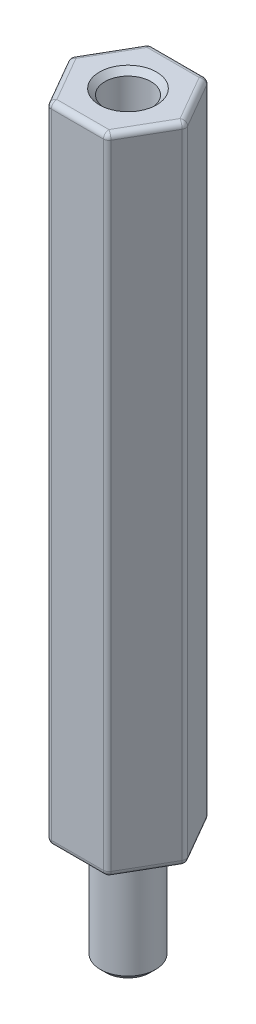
ISO-10303-21;
HEADER;
FILE_DESCRIPTION(('STEP AP214'),'2;1');
FILE_NAME('part.step','',(''),(''),'','','');
FILE_SCHEMA(('AUTOMOTIVE_DESIGN { 1 0 10303 214 1 1 1 1 }'));
ENDSEC;
DATA;
#1=APPLICATION_CONTEXT('core data for automotive mechanical design processes');
#2=APPLICATION_PROTOCOL_DEFINITION('international standard','automotive_design',2000,#1);
#3=PRODUCT_CONTEXT('',#1,'mechanical');
#4=PRODUCT('Part','Part','',(#3));
#5=PRODUCT_RELATED_PRODUCT_CATEGORY('part','',(#4));
#6=PRODUCT_DEFINITION_FORMATION('','',#4);
#7=PRODUCT_DEFINITION_CONTEXT('part definition',#1,'design');
#8=PRODUCT_DEFINITION('design','',#6,#7);
#9=PRODUCT_DEFINITION_SHAPE('','',#8);
#10=(LENGTH_UNIT() NAMED_UNIT(*) SI_UNIT(.MILLI.,.METRE.));
#11=(NAMED_UNIT(*) PLANE_ANGLE_UNIT() SI_UNIT($,.RADIAN.));
#12=(NAMED_UNIT(*) SI_UNIT($,.STERADIAN.) SOLID_ANGLE_UNIT());
#13=UNCERTAINTY_MEASURE_WITH_UNIT(LENGTH_MEASURE(1.E-05),#10,'distance_accuracy_value','');
#14=(GEOMETRIC_REPRESENTATION_CONTEXT(3) GLOBAL_UNCERTAINTY_ASSIGNED_CONTEXT((#13)) GLOBAL_UNIT_ASSIGNED_CONTEXT((#10,
#11,#12)) REPRESENTATION_CONTEXT('',''));
#15=CARTESIAN_POINT('',(0.,0.,0.));
#16=DIRECTION('',(0.,0.,1.));
#17=DIRECTION('',(1.,0.,0.));
#18=AXIS2_PLACEMENT_3D('',#15,#16,#17);
#19=CARTESIAN_POINT('',(0.,35.,0.));
#20=DIRECTION('',(0.,1.,0.));
#21=DIRECTION('',(0.,0.,1.));
#22=AXIS2_PLACEMENT_3D('',#19,#20,#21);
#23=PLANE('',#22);
#24=CARTESIAN_POINT('',(0.,35.,0.));
#25=DIRECTION('',(0.,1.,0.));
#26=DIRECTION('',(0.,0.,1.));
#27=AXIS2_PLACEMENT_3D('',#24,#25,#26);
#28=CIRCLE('',#27,1.55);
#29=CARTESIAN_POINT('',(0.,35.,1.55));
#30=VERTEX_POINT('',#29);
#31=EDGE_CURVE('E319',#30,#30,#28,.F.);
#32=ORIENTED_EDGE('',*,*,#31,.T.);
#33=EDGE_LOOP('',(#32));
#34=FACE_BOUND('',#33,.T.);
#35=DIRECTION('',(-0.5,0.,0.866025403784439));
#36=VECTOR('',#35,1.);
#37=CARTESIAN_POINT('',(-2.82901631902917,35.,0.));
#38=LINE('',#37,#36);
#39=CARTESIAN_POINT('',(-1.41450815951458,35.,-2.45));
#40=VERTEX_POINT('',#39);
#41=CARTESIAN_POINT('',(-2.82901631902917,35.,0.));
#42=VERTEX_POINT('',#41);
#43=EDGE_CURVE('E63',#40,#42,#38,.T.);
#44=ORIENTED_EDGE('',*,*,#43,.T.);
#45=DIRECTION('',(0.5,0.,0.866025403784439));
#46=VECTOR('',#45,1.);
#47=CARTESIAN_POINT('',(-1.41450815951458,35.,2.45));
#48=LINE('',#47,#46);
#49=CARTESIAN_POINT('',(-1.41450815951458,35.,2.45));
#50=VERTEX_POINT('',#49);
#51=EDGE_CURVE('E646',#42,#50,#48,.T.);
#52=ORIENTED_EDGE('',*,*,#51,.T.);
#53=DIRECTION('',(1.,0.,0.));
#54=VECTOR('',#53,1.);
#55=CARTESIAN_POINT('',(1.41450815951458,35.,2.45));
#56=LINE('',#55,#54);
#57=CARTESIAN_POINT('',(1.41450815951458,35.,2.45));
#58=VERTEX_POINT('',#57);
#59=EDGE_CURVE('E633',#50,#58,#56,.T.);
#60=ORIENTED_EDGE('',*,*,#59,.T.);
#61=DIRECTION('',(0.5,0.,-0.866025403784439));
#62=VECTOR('',#61,1.);
#63=CARTESIAN_POINT('',(2.82901631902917,35.,0.));
#64=LINE('',#63,#62);
#65=CARTESIAN_POINT('',(2.82901631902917,35.,0.));
#66=VERTEX_POINT('',#65);
#67=EDGE_CURVE('E636',#58,#66,#64,.T.);
#68=ORIENTED_EDGE('',*,*,#67,.T.);
#69=DIRECTION('',(-0.5,0.,-0.866025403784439));
#70=VECTOR('',#69,1.);
#71=CARTESIAN_POINT('',(1.41450815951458,35.,-2.45));
#72=LINE('',#71,#70);
#73=CARTESIAN_POINT('',(1.41450815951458,35.,-2.45));
#74=VERTEX_POINT('',#73);
#75=EDGE_CURVE('E639',#66,#74,#72,.T.);
#76=ORIENTED_EDGE('',*,*,#75,.T.);
#77=DIRECTION('',(-1.,0.,0.));
#78=VECTOR('',#77,1.);
#79=CARTESIAN_POINT('',(-1.41450815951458,35.,-2.45));
#80=LINE('',#79,#78);
#81=EDGE_CURVE('E68',#74,#40,#80,.T.);
#82=ORIENTED_EDGE('',*,*,#81,.T.);
#83=EDGE_LOOP('',(#44,#52,#60,#68,#76,#82));
#84=FACE_BOUND('',#83,.T.);
#85=ADVANCED_FACE('F47',(#34,#84),#23,.T.);
#86=CARTESIAN_POINT('',(0.,0.,0.));
#87=DIRECTION('',(0.,1.,0.));
#88=DIRECTION('',(0.,0.,1.));
#89=AXIS2_PLACEMENT_3D('',#86,#87,#88);
#90=PLANE('',#89);
#91=CARTESIAN_POINT('',(0.,0.,0.));
#92=DIRECTION('',(0.,1.,0.));
#93=DIRECTION('',(0.,0.,1.));
#94=AXIS2_PLACEMENT_3D('',#91,#92,#93);
#95=CIRCLE('',#94,1.8);
#96=CARTESIAN_POINT('',(0.,0.,1.8));
#97=VERTEX_POINT('',#96);
#98=EDGE_CURVE('E11',#97,#97,#95,.T.);
#99=ORIENTED_EDGE('',*,*,#98,.T.);
#100=EDGE_LOOP('',(#99));
#101=FACE_BOUND('',#100,.T.);
#102=DIRECTION('',(1.,0.,0.));
#103=VECTOR('',#102,1.);
#104=CARTESIAN_POINT('',(0.,0.,2.45));
#105=LINE('',#104,#103);
#106=CARTESIAN_POINT('',(1.41450815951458,0.,2.45));
#107=VERTEX_POINT('',#106);
#108=CARTESIAN_POINT('',(-1.41450815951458,0.,2.45));
#109=VERTEX_POINT('',#108);
#110=EDGE_CURVE('E184',#107,#109,#105,.F.);
#111=ORIENTED_EDGE('',*,*,#110,.T.);
#112=DIRECTION('',(0.5,0.,0.866025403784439));
#113=VECTOR('',#112,1.);
#114=CARTESIAN_POINT('',(-2.12176223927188,0.,1.225));
#115=LINE('',#114,#113);
#116=CARTESIAN_POINT('',(-2.82901631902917,0.,0.));
#117=VERTEX_POINT('',#116);
#118=EDGE_CURVE('E212',#109,#117,#115,.F.);
#119=ORIENTED_EDGE('',*,*,#118,.T.);
#120=DIRECTION('',(-0.5,0.,0.866025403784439));
#121=VECTOR('',#120,1.);
#122=CARTESIAN_POINT('',(-2.12176223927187,0.,-1.225));
#123=LINE('',#122,#121);
#124=CARTESIAN_POINT('',(-1.41450815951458,0.,-2.45));
#125=VERTEX_POINT('',#124);
#126=EDGE_CURVE('E574',#117,#125,#123,.F.);
#127=ORIENTED_EDGE('',*,*,#126,.T.);
#128=DIRECTION('',(-1.,0.,0.));
#129=VECTOR('',#128,1.);
#130=CARTESIAN_POINT('',(0.,0.,-2.45));
#131=LINE('',#130,#129);
#132=CARTESIAN_POINT('',(1.41450815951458,0.,-2.45));
#133=VERTEX_POINT('',#132);
#134=EDGE_CURVE('E571',#125,#133,#131,.F.);
#135=ORIENTED_EDGE('',*,*,#134,.T.);
#136=DIRECTION('',(-0.5,0.,-0.866025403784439));
#137=VECTOR('',#136,1.);
#138=CARTESIAN_POINT('',(2.12176223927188,0.,-1.225));
#139=LINE('',#138,#137);
#140=CARTESIAN_POINT('',(2.82901631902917,0.,0.));
#141=VERTEX_POINT('',#140);
#142=EDGE_CURVE('E568',#133,#141,#139,.F.);
#143=ORIENTED_EDGE('',*,*,#142,.T.);
#144=DIRECTION('',(0.5,0.,-0.866025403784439));
#145=VECTOR('',#144,1.);
#146=CARTESIAN_POINT('',(2.12176223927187,0.,1.225));
#147=LINE('',#146,#145);
#148=EDGE_CURVE('E565',#141,#107,#147,.F.);
#149=ORIENTED_EDGE('',*,*,#148,.T.);
#150=EDGE_LOOP('',(#111,#119,#127,#135,#143,#149));
#151=FACE_BOUND('',#150,.T.);
#152=ADVANCED_FACE('F339',(#101,#151),#90,.F.);
#153=CARTESIAN_POINT('',(1.58771324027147,35.,-2.75));
#154=DIRECTION('',(0.,0.,1.));
#155=DIRECTION('',(1.,0.,0.));
#156=AXIS2_PLACEMENT_3D('',#153,#154,#155);
#157=PLANE('',#156);
#158=DIRECTION('',(0.,-1.,0.));
#159=VECTOR('',#158,1.);
#160=CARTESIAN_POINT('',(1.41450815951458,35.,-2.75));
#161=LINE('',#160,#159);
#162=CARTESIAN_POINT('',(1.41450815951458,34.7,-2.75));
#163=VERTEX_POINT('',#162);
#164=CARTESIAN_POINT('',(1.41450815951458,0.300000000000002,-2.75));
#165=VERTEX_POINT('',#164);
#166=EDGE_CURVE('E521',#163,#165,#161,.T.);
#167=ORIENTED_EDGE('',*,*,#166,.T.);
#168=DIRECTION('',(-1.,0.,0.));
#169=VECTOR('',#168,1.);
#170=CARTESIAN_POINT('',(1.58771324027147,0.300000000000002,-2.75));
#171=LINE('',#170,#169);
#172=CARTESIAN_POINT('',(-1.41450815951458,0.300000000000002,-2.75));
#173=VERTEX_POINT('',#172);
#174=EDGE_CURVE('E600',#165,#173,#171,.T.);
#175=ORIENTED_EDGE('',*,*,#174,.T.);
#176=DIRECTION('',(0.,-1.,0.));
#177=VECTOR('',#176,1.);
#178=CARTESIAN_POINT('',(-1.41450815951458,35.,-2.75));
#179=LINE('',#178,#177);
#180=CARTESIAN_POINT('',(-1.41450815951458,34.7,-2.75));
#181=VERTEX_POINT('',#180);
#182=EDGE_CURVE('E517',#173,#181,#179,.F.);
#183=ORIENTED_EDGE('',*,*,#182,.T.);
#184=DIRECTION('',(-1.,0.,0.));
#185=VECTOR('',#184,1.);
#186=CARTESIAN_POINT('',(1.41450815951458,34.7,-2.75));
#187=LINE('',#186,#185);
#188=EDGE_CURVE('E597',#181,#163,#187,.F.);
#189=ORIENTED_EDGE('',*,*,#188,.T.);
#190=EDGE_LOOP('',(#167,#175,#183,#189));
#191=FACE_BOUND('',#190,.T.);
#192=ADVANCED_FACE('F345',(#191),#157,.F.);
#193=CARTESIAN_POINT('',(-1.58771324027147,35.,-2.75));
#194=DIRECTION('',(0.866025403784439,0.,0.5));
#195=DIRECTION('',(0.5,0.,-0.866025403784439));
#196=AXIS2_PLACEMENT_3D('',#193,#194,#195);
#197=PLANE('',#196);
#198=DIRECTION('',(0.,-1.,0.));
#199=VECTOR('',#198,1.);
#200=CARTESIAN_POINT('',(-1.67431578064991,35.,-2.6));
#201=LINE('',#200,#199);
#202=CARTESIAN_POINT('',(-1.67431578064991,34.7,-2.6));
#203=VERTEX_POINT('',#202);
#204=CARTESIAN_POINT('',(-1.67431578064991,0.300000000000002,-2.6));
#205=VERTEX_POINT('',#204);
#206=EDGE_CURVE('E198',#203,#205,#201,.T.);
#207=ORIENTED_EDGE('',*,*,#206,.T.);
#208=DIRECTION('',(-0.5,0.,0.866025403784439));
#209=VECTOR('',#208,1.);
#210=CARTESIAN_POINT('',(-1.58771324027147,0.300000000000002,-2.75));
#211=LINE('',#210,#209);
#212=CARTESIAN_POINT('',(-3.0888239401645,0.300000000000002,-0.15));
#213=VERTEX_POINT('',#212);
#214=EDGE_CURVE('E588',#205,#213,#211,.T.);
#215=ORIENTED_EDGE('',*,*,#214,.T.);
#216=DIRECTION('',(0.,-1.,0.));
#217=VECTOR('',#216,1.);
#218=CARTESIAN_POINT('',(-3.0888239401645,35.,-0.15));
#219=LINE('',#218,#217);
#220=CARTESIAN_POINT('',(-3.0888239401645,34.7,-0.15));
#221=VERTEX_POINT('',#220);
#222=EDGE_CURVE('E543',#213,#221,#219,.F.);
#223=ORIENTED_EDGE('',*,*,#222,.T.);
#224=DIRECTION('',(-0.5,0.,0.866025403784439));
#225=VECTOR('',#224,1.);
#226=CARTESIAN_POINT('',(-1.67431578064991,34.7,-2.6));
#227=LINE('',#226,#225);
#228=EDGE_CURVE('E585',#221,#203,#227,.F.);
#229=ORIENTED_EDGE('',*,*,#228,.T.);
#230=EDGE_LOOP('',(#207,#215,#223,#229));
#231=FACE_BOUND('',#230,.T.);
#232=ADVANCED_FACE('F366',(#231),#197,.F.);
#233=CARTESIAN_POINT('',(-3.17542648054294,35.,0.));
#234=DIRECTION('',(0.866025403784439,0.,-0.5));
#235=DIRECTION('',(-0.5,0.,-0.866025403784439));
#236=AXIS2_PLACEMENT_3D('',#233,#234,#235);
#237=PLANE('',#236);
#238=DIRECTION('',(0.,-1.,0.));
#239=VECTOR('',#238,1.);
#240=CARTESIAN_POINT('',(-3.0888239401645,35.,0.149999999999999));
#241=LINE('',#240,#239);
#242=CARTESIAN_POINT('',(-3.0888239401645,34.7,0.149999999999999));
#243=VERTEX_POINT('',#242);
#244=CARTESIAN_POINT('',(-3.0888239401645,0.300000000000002,0.149999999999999));
#245=VERTEX_POINT('',#244);
#246=EDGE_CURVE('E179',#243,#245,#241,.T.);
#247=ORIENTED_EDGE('',*,*,#246,.T.);
#248=DIRECTION('',(0.5,0.,0.866025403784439));
#249=VECTOR('',#248,1.);
#250=CARTESIAN_POINT('',(-3.17542648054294,0.300000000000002,0.));
#251=LINE('',#250,#249);
#252=CARTESIAN_POINT('',(-1.67431578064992,0.300000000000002,2.6));
#253=VERTEX_POINT('',#252);
#254=EDGE_CURVE('E174',#245,#253,#251,.T.);
#255=ORIENTED_EDGE('',*,*,#254,.T.);
#256=DIRECTION('',(0.,-1.,0.));
#257=VECTOR('',#256,1.);
#258=CARTESIAN_POINT('',(-1.67431578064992,35.,2.6));
#259=LINE('',#258,#257);
#260=CARTESIAN_POINT('',(-1.67431578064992,34.7,2.6));
#261=VERTEX_POINT('',#260);
#262=EDGE_CURVE('E177',#253,#261,#259,.F.);
#263=ORIENTED_EDGE('',*,*,#262,.T.);
#264=DIRECTION('',(0.5,0.,0.866025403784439));
#265=VECTOR('',#264,1.);
#266=CARTESIAN_POINT('',(-3.0888239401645,34.7,0.149999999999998));
#267=LINE('',#266,#265);
#268=EDGE_CURVE('E185',#261,#243,#267,.F.);
#269=ORIENTED_EDGE('',*,*,#268,.T.);
#270=EDGE_LOOP('',(#247,#255,#263,#269));
#271=FACE_BOUND('',#270,.T.);
#272=ADVANCED_FACE('F176',(#271),#237,.F.);
#273=CARTESIAN_POINT('',(-1.58771324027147,35.,2.75));
#274=DIRECTION('',(0.,0.,-1.));
#275=DIRECTION('',(-1.,0.,0.));
#276=AXIS2_PLACEMENT_3D('',#273,#274,#275);
#277=PLANE('',#276);
#278=DIRECTION('',(0.,-1.,0.));
#279=VECTOR('',#278,1.);
#280=CARTESIAN_POINT('',(-1.41450815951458,35.,2.75));
#281=LINE('',#280,#279);
#282=CARTESIAN_POINT('',(-1.41450815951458,34.7,2.75));
#283=VERTEX_POINT('',#282);
#284=CARTESIAN_POINT('',(-1.41450815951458,0.300000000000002,2.75));
#285=VERTEX_POINT('',#284);
#286=EDGE_CURVE('E556',#283,#285,#281,.T.);
#287=ORIENTED_EDGE('',*,*,#286,.T.);
#288=DIRECTION('',(1.,0.,0.));
#289=VECTOR('',#288,1.);
#290=CARTESIAN_POINT('',(-1.58771324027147,0.300000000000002,2.75));
#291=LINE('',#290,#289);
#292=CARTESIAN_POINT('',(1.41450815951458,0.300000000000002,2.75));
#293=VERTEX_POINT('',#292);
#294=EDGE_CURVE('E224',#285,#293,#291,.T.);
#295=ORIENTED_EDGE('',*,*,#294,.T.);
#296=DIRECTION('',(0.,-1.,0.));
#297=VECTOR('',#296,1.);
#298=CARTESIAN_POINT('',(1.41450815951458,35.,2.75));
#299=LINE('',#298,#297);
#300=CARTESIAN_POINT('',(1.41450815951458,34.7,2.75));
#301=VERTEX_POINT('',#300);
#302=EDGE_CURVE('E552',#293,#301,#299,.F.);
#303=ORIENTED_EDGE('',*,*,#302,.T.);
#304=DIRECTION('',(1.,0.,0.));
#305=VECTOR('',#304,1.);
#306=CARTESIAN_POINT('',(-1.41450815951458,34.7,2.75));
#307=LINE('',#306,#305);
#308=EDGE_CURVE('E648',#301,#283,#307,.F.);
#309=ORIENTED_EDGE('',*,*,#308,.T.);
#310=EDGE_LOOP('',(#287,#295,#303,#309));
#311=FACE_BOUND('',#310,.T.);
#312=ADVANCED_FACE('F359',(#311),#277,.F.);
#313=CARTESIAN_POINT('',(1.58771324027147,35.,2.75));
#314=DIRECTION('',(-0.866025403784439,0.,-0.5));
#315=DIRECTION('',(-0.5,0.,0.866025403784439));
#316=AXIS2_PLACEMENT_3D('',#313,#314,#315);
#317=PLANE('',#316);
#318=DIRECTION('',(0.,-1.,0.));
#319=VECTOR('',#318,1.);
#320=CARTESIAN_POINT('',(1.67431578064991,35.,2.6));
#321=LINE('',#320,#319);
#322=CARTESIAN_POINT('',(1.67431578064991,34.7,2.6));
#323=VERTEX_POINT('',#322);
#324=CARTESIAN_POINT('',(1.67431578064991,0.300000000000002,2.6));
#325=VERTEX_POINT('',#324);
#326=EDGE_CURVE('E535',#323,#325,#321,.T.);
#327=ORIENTED_EDGE('',*,*,#326,.T.);
#328=DIRECTION('',(0.5,0.,-0.866025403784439));
#329=VECTOR('',#328,1.);
#330=CARTESIAN_POINT('',(1.58771324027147,0.300000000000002,2.75));
#331=LINE('',#330,#329);
#332=CARTESIAN_POINT('',(3.0888239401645,0.300000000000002,0.149999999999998));
#333=VERTEX_POINT('',#332);
#334=EDGE_CURVE('E624',#325,#333,#331,.T.);
#335=ORIENTED_EDGE('',*,*,#334,.T.);
#336=DIRECTION('',(0.,-1.,0.));
#337=VECTOR('',#336,1.);
#338=CARTESIAN_POINT('',(3.0888239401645,35.,0.149999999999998));
#339=LINE('',#338,#337);
#340=CARTESIAN_POINT('',(3.0888239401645,34.7,0.149999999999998));
#341=VERTEX_POINT('',#340);
#342=EDGE_CURVE('E539',#333,#341,#339,.F.);
#343=ORIENTED_EDGE('',*,*,#342,.T.);
#344=DIRECTION('',(0.5,0.,-0.866025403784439));
#345=VECTOR('',#344,1.);
#346=CARTESIAN_POINT('',(1.67431578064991,34.7,2.6));
#347=LINE('',#346,#345);
#348=EDGE_CURVE('E621',#341,#323,#347,.F.);
#349=ORIENTED_EDGE('',*,*,#348,.T.);
#350=EDGE_LOOP('',(#327,#335,#343,#349));
#351=FACE_BOUND('',#350,.T.);
#352=ADVANCED_FACE('F355',(#351),#317,.F.);
#353=CARTESIAN_POINT('',(3.17542648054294,35.,0.));
#354=DIRECTION('',(-0.866025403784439,0.,0.5));
#355=DIRECTION('',(0.5,0.,0.866025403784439));
#356=AXIS2_PLACEMENT_3D('',#353,#354,#355);
#357=PLANE('',#356);
#358=DIRECTION('',(0.,-1.,0.));
#359=VECTOR('',#358,1.);
#360=CARTESIAN_POINT('',(3.0888239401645,35.,-0.150000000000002));
#361=LINE('',#360,#359);
#362=CARTESIAN_POINT('',(3.0888239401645,34.7,-0.150000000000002));
#363=VERTEX_POINT('',#362);
#364=CARTESIAN_POINT('',(3.0888239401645,0.300000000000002,-0.150000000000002));
#365=VERTEX_POINT('',#364);
#366=EDGE_CURVE('E527',#363,#365,#361,.T.);
#367=ORIENTED_EDGE('',*,*,#366,.T.);
#368=DIRECTION('',(-0.5,0.,-0.866025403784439));
#369=VECTOR('',#368,1.);
#370=CARTESIAN_POINT('',(3.17542648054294,0.300000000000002,0.));
#371=LINE('',#370,#369);
#372=CARTESIAN_POINT('',(1.67431578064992,0.300000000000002,-2.6));
#373=VERTEX_POINT('',#372);
#374=EDGE_CURVE('E612',#365,#373,#371,.T.);
#375=ORIENTED_EDGE('',*,*,#374,.T.);
#376=DIRECTION('',(0.,-1.,0.));
#377=VECTOR('',#376,1.);
#378=CARTESIAN_POINT('',(1.67431578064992,35.,-2.6));
#379=LINE('',#378,#377);
#380=CARTESIAN_POINT('',(1.67431578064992,34.7,-2.6));
#381=VERTEX_POINT('',#380);
#382=EDGE_CURVE('E531',#373,#381,#379,.F.);
#383=ORIENTED_EDGE('',*,*,#382,.T.);
#384=DIRECTION('',(-0.5,0.,-0.866025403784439));
#385=VECTOR('',#384,1.);
#386=CARTESIAN_POINT('',(3.0888239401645,34.7,-0.150000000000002));
#387=LINE('',#386,#385);
#388=EDGE_CURVE('E609',#381,#363,#387,.F.);
#389=ORIENTED_EDGE('',*,*,#388,.T.);
#390=EDGE_LOOP('',(#367,#375,#383,#389));
#391=FACE_BOUND('',#390,.T.);
#392=ADVANCED_FACE('F352',(#391),#357,.F.);
#393=CARTESIAN_POINT('',(0.,35.,0.));
#394=DIRECTION('',(0.,-1.,0.));
#395=DIRECTION('',(0.,0.,-1.));
#396=AXIS2_PLACEMENT_3D('',#393,#394,#395);
#397=CYLINDRICAL_SURFACE('',#396,1.25);
#398=CARTESIAN_POINT('',(0.,34.7,0.));
#399=DIRECTION('',(0.,1.,0.));
#400=DIRECTION('',(0.,0.,1.));
#401=AXIS2_PLACEMENT_3D('',#398,#399,#400);
#402=CIRCLE('',#401,1.25);
#403=CARTESIAN_POINT('',(0.,34.7,1.25));
#404=VERTEX_POINT('',#403);
#405=EDGE_CURVE('E315',#404,#404,#402,.T.);
#406=ORIENTED_EDGE('',*,*,#405,.T.);
#407=EDGE_LOOP('',(#406));
#408=FACE_BOUND('',#407,.T.);
#409=CARTESIAN_POINT('',(0.,0.,0.));
#410=DIRECTION('',(0.,1.,0.));
#411=DIRECTION('',(0.,0.,1.));
#412=AXIS2_PLACEMENT_3D('',#409,#410,#411);
#413=CIRCLE('',#412,1.25);
#414=CARTESIAN_POINT('',(0.,0.,1.25));
#415=VERTEX_POINT('',#414);
#416=EDGE_CURVE('E265',#415,#415,#413,.T.);
#417=ORIENTED_EDGE('',*,*,#416,.F.);
#418=EDGE_LOOP('',(#417));
#419=FACE_BOUND('',#418,.T.);
#420=ADVANCED_FACE('F349',(#408,#419),#397,.F.);
#421=CARTESIAN_POINT('',(1.41450815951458,35.,-2.45));
#422=DIRECTION('',(0.,-1.,0.));
#423=DIRECTION('',(0.,0.,-1.));
#424=AXIS2_PLACEMENT_3D('',#421,#422,#423);
#425=CYLINDRICAL_SURFACE('',#424,0.3);
#426=ORIENTED_EDGE('',*,*,#382,.F.);
#427=CARTESIAN_POINT('',(1.41450815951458,0.300000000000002,-2.45));
#428=DIRECTION('',(0.,-1.,0.));
#429=DIRECTION('',(0.,0.,-1.));
#430=AXIS2_PLACEMENT_3D('',#427,#428,#429);
#431=CIRCLE('',#430,0.3);
#432=EDGE_CURVE('E606',#373,#165,#431,.F.);
#433=ORIENTED_EDGE('',*,*,#432,.T.);
#434=ORIENTED_EDGE('',*,*,#166,.F.);
#435=CARTESIAN_POINT('',(1.41450815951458,34.7,-2.45));
#436=DIRECTION('',(0.,-1.,0.));
#437=DIRECTION('',(0.,0.,-1.));
#438=AXIS2_PLACEMENT_3D('',#435,#436,#437);
#439=CIRCLE('',#438,0.3);
#440=EDGE_CURVE('E603',#163,#381,#439,.T.);
#441=ORIENTED_EDGE('',*,*,#440,.T.);
#442=EDGE_LOOP('',(#426,#433,#434,#441));
#443=FACE_BOUND('',#442,.T.);
#444=ADVANCED_FACE('F373',(#443),#425,.T.);
#445=CARTESIAN_POINT('',(2.82901631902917,35.,0.));
#446=DIRECTION('',(0.,-1.,0.));
#447=DIRECTION('',(0.,0.,-1.));
#448=AXIS2_PLACEMENT_3D('',#445,#446,#447);
#449=CYLINDRICAL_SURFACE('',#448,0.3);
#450=ORIENTED_EDGE('',*,*,#342,.F.);
#451=CARTESIAN_POINT('',(2.82901631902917,0.300000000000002,0.));
#452=DIRECTION('',(0.,-1.,0.));
#453=DIRECTION('',(0.,0.,-1.));
#454=AXIS2_PLACEMENT_3D('',#451,#452,#453);
#455=CIRCLE('',#454,0.3);
#456=EDGE_CURVE('E618',#333,#365,#455,.F.);
#457=ORIENTED_EDGE('',*,*,#456,.T.);
#458=ORIENTED_EDGE('',*,*,#366,.F.);
#459=CARTESIAN_POINT('',(2.82901631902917,34.7,0.));
#460=DIRECTION('',(0.,-1.,0.));
#461=DIRECTION('',(0.,0.,-1.));
#462=AXIS2_PLACEMENT_3D('',#459,#460,#461);
#463=CIRCLE('',#462,0.3);
#464=EDGE_CURVE('E615',#363,#341,#463,.T.);
#465=ORIENTED_EDGE('',*,*,#464,.T.);
#466=EDGE_LOOP('',(#450,#457,#458,#465));
#467=FACE_BOUND('',#466,.T.);
#468=ADVANCED_FACE('F376',(#467),#449,.T.);
#469=CARTESIAN_POINT('',(-1.41450815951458,35.,-2.45));
#470=DIRECTION('',(0.,-1.,0.));
#471=DIRECTION('',(0.,0.,-1.));
#472=AXIS2_PLACEMENT_3D('',#469,#470,#471);
#473=CYLINDRICAL_SURFACE('',#472,0.3);
#474=ORIENTED_EDGE('',*,*,#182,.F.);
#475=CARTESIAN_POINT('',(-1.41450815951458,0.300000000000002,-2.45));
#476=DIRECTION('',(0.,-1.,0.));
#477=DIRECTION('',(0.,0.,-1.));
#478=AXIS2_PLACEMENT_3D('',#475,#476,#477);
#479=CIRCLE('',#478,0.3);
#480=EDGE_CURVE('E594',#173,#205,#479,.F.);
#481=ORIENTED_EDGE('',*,*,#480,.T.);
#482=ORIENTED_EDGE('',*,*,#206,.F.);
#483=CARTESIAN_POINT('',(-1.41450815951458,34.7,-2.45));
#484=DIRECTION('',(0.,-1.,0.));
#485=DIRECTION('',(0.,0.,-1.));
#486=AXIS2_PLACEMENT_3D('',#483,#484,#485);
#487=CIRCLE('',#486,0.3);
#488=EDGE_CURVE('E591',#203,#181,#487,.T.);
#489=ORIENTED_EDGE('',*,*,#488,.T.);
#490=EDGE_LOOP('',(#474,#481,#482,#489));
#491=FACE_BOUND('',#490,.T.);
#492=ADVANCED_FACE('F380',(#491),#473,.T.);
#493=CARTESIAN_POINT('',(-2.82901631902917,35.,0.));
#494=DIRECTION('',(0.,-1.,0.));
#495=DIRECTION('',(0.,0.,-1.));
#496=AXIS2_PLACEMENT_3D('',#493,#494,#495);
#497=CYLINDRICAL_SURFACE('',#496,0.3);
#498=ORIENTED_EDGE('',*,*,#222,.F.);
#499=CARTESIAN_POINT('',(-2.82901631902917,0.300000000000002,0.));
#500=DIRECTION('',(0.,-1.,0.));
#501=DIRECTION('',(0.,0.,-1.));
#502=AXIS2_PLACEMENT_3D('',#499,#500,#501);
#503=CIRCLE('',#502,0.3);
#504=EDGE_CURVE('E582',#213,#245,#503,.F.);
#505=ORIENTED_EDGE('',*,*,#504,.T.);
#506=ORIENTED_EDGE('',*,*,#246,.F.);
#507=CARTESIAN_POINT('',(-2.82901631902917,34.7,0.));
#508=DIRECTION('',(0.,-1.,0.));
#509=DIRECTION('',(0.,0.,-1.));
#510=AXIS2_PLACEMENT_3D('',#507,#508,#509);
#511=CIRCLE('',#510,0.3);
#512=EDGE_CURVE('E579',#243,#221,#511,.T.);
#513=ORIENTED_EDGE('',*,*,#512,.T.);
#514=EDGE_LOOP('',(#498,#505,#506,#513));
#515=FACE_BOUND('',#514,.T.);
#516=ADVANCED_FACE('F384',(#515),#497,.T.);
#517=CARTESIAN_POINT('',(-1.41450815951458,35.,2.45));
#518=DIRECTION('',(0.,-1.,0.));
#519=DIRECTION('',(0.,0.,-1.));
#520=AXIS2_PLACEMENT_3D('',#517,#518,#519);
#521=CYLINDRICAL_SURFACE('',#520,0.3);
#522=ORIENTED_EDGE('',*,*,#262,.F.);
#523=CARTESIAN_POINT('',(-1.41450815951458,0.300000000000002,2.45));
#524=DIRECTION('',(0.,-1.,0.));
#525=DIRECTION('',(0.,0.,-1.));
#526=AXIS2_PLACEMENT_3D('',#523,#524,#525);
#527=CIRCLE('',#526,0.3);
#528=EDGE_CURVE('E193',#253,#285,#527,.F.);
#529=ORIENTED_EDGE('',*,*,#528,.T.);
#530=ORIENTED_EDGE('',*,*,#286,.F.);
#531=CARTESIAN_POINT('',(-1.41450815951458,34.7,2.45));
#532=DIRECTION('',(0.,-1.,0.));
#533=DIRECTION('',(0.,0.,-1.));
#534=AXIS2_PLACEMENT_3D('',#531,#532,#533);
#535=CIRCLE('',#534,0.3);
#536=EDGE_CURVE('E196',#283,#261,#535,.T.);
#537=ORIENTED_EDGE('',*,*,#536,.T.);
#538=EDGE_LOOP('',(#522,#529,#530,#537));
#539=FACE_BOUND('',#538,.T.);
#540=ADVANCED_FACE('F191',(#539),#521,.T.);
#541=CARTESIAN_POINT('',(1.41450815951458,35.,2.45));
#542=DIRECTION('',(0.,-1.,0.));
#543=DIRECTION('',(0.,0.,-1.));
#544=AXIS2_PLACEMENT_3D('',#541,#542,#543);
#545=CYLINDRICAL_SURFACE('',#544,0.3);
#546=ORIENTED_EDGE('',*,*,#302,.F.);
#547=CARTESIAN_POINT('',(1.41450815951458,0.300000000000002,2.45));
#548=DIRECTION('',(0.,-1.,0.));
#549=DIRECTION('',(0.,0.,-1.));
#550=AXIS2_PLACEMENT_3D('',#547,#548,#549);
#551=CIRCLE('',#550,0.3);
#552=EDGE_CURVE('E630',#293,#325,#551,.F.);
#553=ORIENTED_EDGE('',*,*,#552,.T.);
#554=ORIENTED_EDGE('',*,*,#326,.F.);
#555=CARTESIAN_POINT('',(1.41450815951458,34.7,2.45));
#556=DIRECTION('',(0.,-1.,0.));
#557=DIRECTION('',(0.,0.,-1.));
#558=AXIS2_PLACEMENT_3D('',#555,#556,#557);
#559=CIRCLE('',#558,0.3);
#560=EDGE_CURVE('E627',#323,#301,#559,.T.);
#561=ORIENTED_EDGE('',*,*,#560,.T.);
#562=EDGE_LOOP('',(#546,#553,#554,#561));
#563=FACE_BOUND('',#562,.T.);
#564=ADVANCED_FACE('F391',(#563),#545,.T.);
#565=CARTESIAN_POINT('',(1.41450815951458,0.300000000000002,-2.45));
#566=DIRECTION('',(0.,1.,0.));
#567=DIRECTION('',(0.,0.,1.));
#568=AXIS2_PLACEMENT_3D('',#565,#566,#567);
#569=SPHERICAL_SURFACE('',#568,0.3);
#570=CARTESIAN_POINT('',(1.41450815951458,0.300000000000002,-2.45));
#571=DIRECTION('',(-1.,0.,0.));
#572=DIRECTION('',(0.,0.,1.));
#573=AXIS2_PLACEMENT_3D('',#570,#571,#572);
#574=CIRCLE('',#573,0.3);
#575=EDGE_CURVE('E257',#165,#133,#574,.T.);
#576=ORIENTED_EDGE('',*,*,#575,.F.);
#577=ORIENTED_EDGE('',*,*,#432,.F.);
#578=CARTESIAN_POINT('',(1.41450815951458,0.300000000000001,-2.45));
#579=DIRECTION('',(0.5,0.,0.866025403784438));
#580=DIRECTION('',(0.866025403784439,0.,-0.5));
#581=AXIS2_PLACEMENT_3D('',#578,#579,#580);
#582=CIRCLE('',#581,0.3);
#583=EDGE_CURVE('E261',#133,#373,#582,.T.);
#584=ORIENTED_EDGE('',*,*,#583,.F.);
#585=EDGE_LOOP('',(#576,#577,#584));
#586=FACE_BOUND('',#585,.T.);
#587=ADVANCED_FACE('F394',(#586),#569,.T.);
#588=CARTESIAN_POINT('',(2.91561885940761,0.300000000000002,0.149999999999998));
#589=DIRECTION('',(-0.5,0.,-0.866025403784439));
#590=DIRECTION('',(-0.866025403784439,0.,0.5));
#591=AXIS2_PLACEMENT_3D('',#588,#589,#590);
#592=CYLINDRICAL_SURFACE('',#591,0.3);
#593=ORIENTED_EDGE('',*,*,#583,.T.);
#594=ORIENTED_EDGE('',*,*,#374,.F.);
#595=CARTESIAN_POINT('',(2.82901631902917,0.3,0.));
#596=DIRECTION('',(0.5,0.,0.866025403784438));
#597=DIRECTION('',(0.866025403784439,0.,-0.5));
#598=AXIS2_PLACEMENT_3D('',#595,#596,#597);
#599=CIRCLE('',#598,0.3);
#600=EDGE_CURVE('E253',#141,#365,#599,.T.);
#601=ORIENTED_EDGE('',*,*,#600,.F.);
#602=ORIENTED_EDGE('',*,*,#142,.F.);
#603=EDGE_LOOP('',(#593,#594,#601,#602));
#604=FACE_BOUND('',#603,.T.);
#605=ADVANCED_FACE('F432',(#604),#592,.T.);
#606=CARTESIAN_POINT('',(1.58771324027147,0.300000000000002,-2.45));
#607=DIRECTION('',(-1.,0.,0.));
#608=DIRECTION('',(0.,0.,1.));
#609=AXIS2_PLACEMENT_3D('',#606,#607,#608);
#610=CYLINDRICAL_SURFACE('',#609,0.3);
#611=ORIENTED_EDGE('',*,*,#575,.T.);
#612=ORIENTED_EDGE('',*,*,#134,.F.);
#613=CARTESIAN_POINT('',(-1.41450815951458,0.300000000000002,-2.45));
#614=DIRECTION('',(-1.,0.,0.));
#615=DIRECTION('',(0.,-1.,0.));
#616=AXIS2_PLACEMENT_3D('',#613,#614,#615);
#617=CIRCLE('',#616,0.3);
#618=EDGE_CURVE('E249',#173,#125,#617,.T.);
#619=ORIENTED_EDGE('',*,*,#618,.F.);
#620=ORIENTED_EDGE('',*,*,#174,.F.);
#621=EDGE_LOOP('',(#611,#612,#619,#620));
#622=FACE_BOUND('',#621,.T.);
#623=ADVANCED_FACE('F428',(#622),#610,.T.);
#624=CARTESIAN_POINT('',(2.82901631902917,0.300000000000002,0.));
#625=DIRECTION('',(0.,1.,0.));
#626=DIRECTION('',(0.,0.,1.));
#627=AXIS2_PLACEMENT_3D('',#624,#625,#626);
#628=SPHERICAL_SURFACE('',#627,0.3);
#629=ORIENTED_EDGE('',*,*,#600,.T.);
#630=ORIENTED_EDGE('',*,*,#456,.F.);
#631=CARTESIAN_POINT('',(2.82901631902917,0.300000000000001,0.));
#632=DIRECTION('',(-0.5,0.,0.866025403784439));
#633=DIRECTION('',(0.866025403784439,0.,0.5));
#634=AXIS2_PLACEMENT_3D('',#631,#632,#633);
#635=CIRCLE('',#634,0.3);
#636=EDGE_CURVE('E245',#141,#333,#635,.T.);
#637=ORIENTED_EDGE('',*,*,#636,.F.);
#638=EDGE_LOOP('',(#629,#630,#637));
#639=FACE_BOUND('',#638,.T.);
#640=ADVANCED_FACE('F424',(#639),#628,.T.);
#641=CARTESIAN_POINT('',(-1.41450815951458,0.300000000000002,-2.45));
#642=DIRECTION('',(0.,1.,0.));
#643=DIRECTION('',(0.,0.,1.));
#644=AXIS2_PLACEMENT_3D('',#641,#642,#643);
#645=SPHERICAL_SURFACE('',#644,0.3);
#646=ORIENTED_EDGE('',*,*,#480,.F.);
#647=ORIENTED_EDGE('',*,*,#618,.T.);
#648=CARTESIAN_POINT('',(-1.41450815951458,0.300000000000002,-2.45));
#649=DIRECTION('',(-0.5,0.,0.866025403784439));
#650=DIRECTION('',(0.866025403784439,0.,0.5));
#651=AXIS2_PLACEMENT_3D('',#648,#649,#650);
#652=CIRCLE('',#651,0.3);
#653=EDGE_CURVE('E241',#205,#125,#652,.T.);
#654=ORIENTED_EDGE('',*,*,#653,.F.);
#655=EDGE_LOOP('',(#646,#647,#654));
#656=FACE_BOUND('',#655,.T.);
#657=ADVANCED_FACE('F420',(#656),#645,.T.);
#658=CARTESIAN_POINT('',(1.32790561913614,0.300000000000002,2.6));
#659=DIRECTION('',(0.5,0.,-0.866025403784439));
#660=DIRECTION('',(-0.866025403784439,0.,-0.5));
#661=AXIS2_PLACEMENT_3D('',#658,#659,#660);
#662=CYLINDRICAL_SURFACE('',#661,0.3);
#663=ORIENTED_EDGE('',*,*,#636,.T.);
#664=ORIENTED_EDGE('',*,*,#334,.F.);
#665=CARTESIAN_POINT('',(1.41450815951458,0.3,2.45));
#666=DIRECTION('',(-0.5,0.,0.866025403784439));
#667=DIRECTION('',(0.866025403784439,0.,0.5));
#668=AXIS2_PLACEMENT_3D('',#665,#666,#667);
#669=CIRCLE('',#668,0.3);
#670=EDGE_CURVE('E237',#107,#325,#669,.T.);
#671=ORIENTED_EDGE('',*,*,#670,.F.);
#672=ORIENTED_EDGE('',*,*,#148,.F.);
#673=EDGE_LOOP('',(#663,#664,#671,#672));
#674=FACE_BOUND('',#673,.T.);
#675=ADVANCED_FACE('F416',(#674),#662,.T.);
#676=CARTESIAN_POINT('',(-1.32790561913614,0.300000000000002,-2.6));
#677=DIRECTION('',(-0.5,0.,0.866025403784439));
#678=DIRECTION('',(0.866025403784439,0.,0.5));
#679=AXIS2_PLACEMENT_3D('',#676,#677,#678);
#680=CYLINDRICAL_SURFACE('',#679,0.3);
#681=ORIENTED_EDGE('',*,*,#653,.T.);
#682=ORIENTED_EDGE('',*,*,#126,.F.);
#683=CARTESIAN_POINT('',(-2.82901631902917,0.300000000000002,0.));
#684=DIRECTION('',(-0.5,0.,0.866025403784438));
#685=DIRECTION('',(0.866025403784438,0.,0.5));
#686=AXIS2_PLACEMENT_3D('',#683,#684,#685);
#687=CIRCLE('',#686,0.3);
#688=EDGE_CURVE('E233',#213,#117,#687,.T.);
#689=ORIENTED_EDGE('',*,*,#688,.F.);
#690=ORIENTED_EDGE('',*,*,#214,.F.);
#691=EDGE_LOOP('',(#681,#682,#689,#690));
#692=FACE_BOUND('',#691,.T.);
#693=ADVANCED_FACE('F412',(#692),#680,.T.);
#694=CARTESIAN_POINT('',(1.41450815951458,0.300000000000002,2.45));
#695=DIRECTION('',(0.,1.,0.));
#696=DIRECTION('',(0.,0.,1.));
#697=AXIS2_PLACEMENT_3D('',#694,#695,#696);
#698=SPHERICAL_SURFACE('',#697,0.3);
#699=ORIENTED_EDGE('',*,*,#670,.T.);
#700=ORIENTED_EDGE('',*,*,#552,.F.);
#701=CARTESIAN_POINT('',(1.41450815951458,0.300000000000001,2.45));
#702=DIRECTION('',(-1.,0.,0.));
#703=DIRECTION('',(0.,0.,1.));
#704=AXIS2_PLACEMENT_3D('',#701,#702,#703);
#705=CIRCLE('',#704,0.3);
#706=EDGE_CURVE('E229',#107,#293,#705,.T.);
#707=ORIENTED_EDGE('',*,*,#706,.F.);
#708=EDGE_LOOP('',(#699,#700,#707));
#709=FACE_BOUND('',#708,.T.);
#710=ADVANCED_FACE('F408',(#709),#698,.T.);
#711=CARTESIAN_POINT('',(-2.82901631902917,0.300000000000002,0.));
#712=DIRECTION('',(0.,1.,0.));
#713=DIRECTION('',(0.,0.,1.));
#714=AXIS2_PLACEMENT_3D('',#711,#712,#713);
#715=SPHERICAL_SURFACE('',#714,0.3);
#716=ORIENTED_EDGE('',*,*,#504,.F.);
#717=ORIENTED_EDGE('',*,*,#688,.T.);
#718=CARTESIAN_POINT('',(-2.82901631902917,0.300000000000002,0.));
#719=DIRECTION('',(0.5,0.,0.866025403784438));
#720=DIRECTION('',(0.866025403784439,0.,-0.5));
#721=AXIS2_PLACEMENT_3D('',#718,#719,#720);
#722=CIRCLE('',#721,0.3);
#723=EDGE_CURVE('E218',#245,#117,#722,.T.);
#724=ORIENTED_EDGE('',*,*,#723,.F.);
#725=EDGE_LOOP('',(#716,#717,#724));
#726=FACE_BOUND('',#725,.T.);
#727=ADVANCED_FACE('F404',(#726),#715,.T.);
#728=CARTESIAN_POINT('',(-1.58771324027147,0.300000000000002,2.45));
#729=DIRECTION('',(1.,0.,0.));
#730=DIRECTION('',(0.,0.,-1.));
#731=AXIS2_PLACEMENT_3D('',#728,#729,#730);
#732=CYLINDRICAL_SURFACE('',#731,0.3);
#733=ORIENTED_EDGE('',*,*,#706,.T.);
#734=ORIENTED_EDGE('',*,*,#294,.F.);
#735=CARTESIAN_POINT('',(-1.41450815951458,0.3,2.45));
#736=DIRECTION('',(-1.,0.,0.));
#737=DIRECTION('',(0.,0.,1.));
#738=AXIS2_PLACEMENT_3D('',#735,#736,#737);
#739=CIRCLE('',#738,0.3);
#740=EDGE_CURVE('E205',#109,#285,#739,.T.);
#741=ORIENTED_EDGE('',*,*,#740,.F.);
#742=ORIENTED_EDGE('',*,*,#110,.F.);
#743=EDGE_LOOP('',(#733,#734,#741,#742));
#744=FACE_BOUND('',#743,.T.);
#745=ADVANCED_FACE('F401',(#744),#732,.T.);
#746=CARTESIAN_POINT('',(-2.91561885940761,0.300000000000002,-0.150000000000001));
#747=DIRECTION('',(0.5,0.,0.866025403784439));
#748=DIRECTION('',(0.866025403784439,0.,-0.5));
#749=AXIS2_PLACEMENT_3D('',#746,#747,#748);
#750=CYLINDRICAL_SURFACE('',#749,0.3);
#751=ORIENTED_EDGE('',*,*,#723,.T.);
#752=ORIENTED_EDGE('',*,*,#118,.F.);
#753=CARTESIAN_POINT('',(-1.41450815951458,0.300000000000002,2.45));
#754=DIRECTION('',(0.5,0.,0.866025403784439));
#755=DIRECTION('',(0.866025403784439,0.,-0.5));
#756=AXIS2_PLACEMENT_3D('',#753,#754,#755);
#757=CIRCLE('',#756,0.3);
#758=EDGE_CURVE('E203',#253,#109,#757,.T.);
#759=ORIENTED_EDGE('',*,*,#758,.F.);
#760=ORIENTED_EDGE('',*,*,#254,.F.);
#761=EDGE_LOOP('',(#751,#752,#759,#760));
#762=FACE_BOUND('',#761,.T.);
#763=ADVANCED_FACE('F210',(#762),#750,.T.);
#764=CARTESIAN_POINT('',(-1.41450815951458,0.300000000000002,2.45));
#765=DIRECTION('',(0.,1.,0.));
#766=DIRECTION('',(0.,0.,1.));
#767=AXIS2_PLACEMENT_3D('',#764,#765,#766);
#768=SPHERICAL_SURFACE('',#767,0.3);
#769=ORIENTED_EDGE('',*,*,#740,.T.);
#770=ORIENTED_EDGE('',*,*,#528,.F.);
#771=ORIENTED_EDGE('',*,*,#758,.T.);
#772=EDGE_LOOP('',(#769,#770,#771));
#773=FACE_BOUND('',#772,.T.);
#774=ADVANCED_FACE('F202',(#773),#768,.T.);
#775=CARTESIAN_POINT('',(1.41450815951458,34.7,-2.45));
#776=DIRECTION('',(0.,1.,0.));
#777=DIRECTION('',(0.,0.,1.));
#778=AXIS2_PLACEMENT_3D('',#775,#776,#777);
#779=SPHERICAL_SURFACE('',#778,0.3);
#780=CARTESIAN_POINT('',(1.41450815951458,34.7,-2.45));
#781=DIRECTION('',(0.5,0.,0.866025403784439));
#782=DIRECTION('',(0.866025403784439,0.,-0.5));
#783=AXIS2_PLACEMENT_3D('',#780,#781,#782);
#784=CIRCLE('',#783,0.3);
#785=EDGE_CURVE('E221',#381,#74,#784,.T.);
#786=ORIENTED_EDGE('',*,*,#785,.F.);
#787=ORIENTED_EDGE('',*,*,#440,.F.);
#788=CARTESIAN_POINT('',(1.41450815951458,34.7,-2.45));
#789=DIRECTION('',(-1.,0.,0.));
#790=DIRECTION('',(0.,0.,1.));
#791=AXIS2_PLACEMENT_3D('',#788,#789,#790);
#792=CIRCLE('',#791,0.3);
#793=EDGE_CURVE('E214',#74,#163,#792,.T.);
#794=ORIENTED_EDGE('',*,*,#793,.F.);
#795=EDGE_LOOP('',(#786,#787,#794));
#796=FACE_BOUND('',#795,.T.);
#797=ADVANCED_FACE('F398',(#796),#779,.T.);
#798=CARTESIAN_POINT('',(0.,34.7,-2.45));
#799=DIRECTION('',(1.,0.,0.));
#800=DIRECTION('',(0.,0.,-1.));
#801=AXIS2_PLACEMENT_3D('',#798,#799,#800);
#802=CYLINDRICAL_SURFACE('',#801,0.3);
#803=ORIENTED_EDGE('',*,*,#793,.T.);
#804=ORIENTED_EDGE('',*,*,#188,.F.);
#805=CARTESIAN_POINT('',(-1.41450815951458,34.7,-2.45));
#806=DIRECTION('',(-1.,0.,0.));
#807=DIRECTION('',(0.,0.,1.));
#808=AXIS2_PLACEMENT_3D('',#805,#806,#807);
#809=CIRCLE('',#808,0.3);
#810=EDGE_CURVE('E300',#40,#181,#809,.T.);
#811=ORIENTED_EDGE('',*,*,#810,.F.);
#812=ORIENTED_EDGE('',*,*,#81,.F.);
#813=EDGE_LOOP('',(#803,#804,#811,#812));
#814=FACE_BOUND('',#813,.T.);
#815=ADVANCED_FACE('F480',(#814),#802,.T.);
#816=CARTESIAN_POINT('',(2.12176223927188,34.7,-1.225));
#817=DIRECTION('',(0.5,0.,0.866025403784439));
#818=DIRECTION('',(0.866025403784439,0.,-0.5));
#819=AXIS2_PLACEMENT_3D('',#816,#817,#818);
#820=CYLINDRICAL_SURFACE('',#819,0.3);
#821=ORIENTED_EDGE('',*,*,#785,.T.);
#822=ORIENTED_EDGE('',*,*,#75,.F.);
#823=CARTESIAN_POINT('',(2.82901631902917,34.7,0.));
#824=DIRECTION('',(0.5,0.,0.866025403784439));
#825=DIRECTION('',(0.866025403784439,0.,-0.5));
#826=AXIS2_PLACEMENT_3D('',#823,#824,#825);
#827=CIRCLE('',#826,0.3);
#828=EDGE_CURVE('E296',#363,#66,#827,.T.);
#829=ORIENTED_EDGE('',*,*,#828,.F.);
#830=ORIENTED_EDGE('',*,*,#388,.F.);
#831=EDGE_LOOP('',(#821,#822,#829,#830));
#832=FACE_BOUND('',#831,.T.);
#833=ADVANCED_FACE('F476',(#832),#820,.T.);
#834=CARTESIAN_POINT('',(-1.41450815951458,34.7,-2.45));
#835=DIRECTION('',(0.,1.,0.));
#836=DIRECTION('',(0.,0.,1.));
#837=AXIS2_PLACEMENT_3D('',#834,#835,#836);
#838=SPHERICAL_SURFACE('',#837,0.3);
#839=ORIENTED_EDGE('',*,*,#810,.T.);
#840=ORIENTED_EDGE('',*,*,#488,.F.);
#841=CARTESIAN_POINT('',(-1.41450815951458,34.7,-2.45));
#842=DIRECTION('',(-0.5,0.,0.866025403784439));
#843=DIRECTION('',(0.866025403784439,0.,0.5));
#844=AXIS2_PLACEMENT_3D('',#841,#842,#843);
#845=CIRCLE('',#844,0.3);
#846=EDGE_CURVE('E292',#40,#203,#845,.T.);
#847=ORIENTED_EDGE('',*,*,#846,.F.);
#848=EDGE_LOOP('',(#839,#840,#847));
#849=FACE_BOUND('',#848,.T.);
#850=ADVANCED_FACE('F472',(#849),#838,.T.);
#851=CARTESIAN_POINT('',(2.82901631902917,34.7,0.));
#852=DIRECTION('',(0.,1.,0.));
#853=DIRECTION('',(0.,0.,1.));
#854=AXIS2_PLACEMENT_3D('',#851,#852,#853);
#855=SPHERICAL_SURFACE('',#854,0.3);
#856=ORIENTED_EDGE('',*,*,#464,.F.);
#857=ORIENTED_EDGE('',*,*,#828,.T.);
#858=CARTESIAN_POINT('',(2.82901631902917,34.7,0.));
#859=DIRECTION('',(-0.499999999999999,0.,0.866025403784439));
#860=DIRECTION('',(0.866025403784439,0.,0.5));
#861=AXIS2_PLACEMENT_3D('',#858,#859,#860);
#862=CIRCLE('',#861,0.3);
#863=EDGE_CURVE('E288',#341,#66,#862,.T.);
#864=ORIENTED_EDGE('',*,*,#863,.F.);
#865=EDGE_LOOP('',(#856,#857,#864));
#866=FACE_BOUND('',#865,.T.);
#867=ADVANCED_FACE('F468',(#866),#855,.T.);
#868=CARTESIAN_POINT('',(-2.12176223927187,34.7,-1.225));
#869=DIRECTION('',(0.5,0.,-0.866025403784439));
#870=DIRECTION('',(-0.866025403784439,0.,-0.5));
#871=AXIS2_PLACEMENT_3D('',#868,#869,#870);
#872=CYLINDRICAL_SURFACE('',#871,0.3);
#873=ORIENTED_EDGE('',*,*,#846,.T.);
#874=ORIENTED_EDGE('',*,*,#228,.F.);
#875=CARTESIAN_POINT('',(-2.82901631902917,34.7,0.));
#876=DIRECTION('',(-0.499999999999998,0.,0.86602540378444));
#877=DIRECTION('',(0.86602540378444,0.,0.499999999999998));
#878=AXIS2_PLACEMENT_3D('',#875,#876,#877);
#879=CIRCLE('',#878,0.3);
#880=EDGE_CURVE('E284',#42,#221,#879,.T.);
#881=ORIENTED_EDGE('',*,*,#880,.F.);
#882=ORIENTED_EDGE('',*,*,#43,.F.);
#883=EDGE_LOOP('',(#873,#874,#881,#882));
#884=FACE_BOUND('',#883,.T.);
#885=ADVANCED_FACE('F464',(#884),#872,.T.);
#886=CARTESIAN_POINT('',(2.12176223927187,34.7,1.225));
#887=DIRECTION('',(-0.5,0.,0.866025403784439));
#888=DIRECTION('',(0.866025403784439,0.,0.5));
#889=AXIS2_PLACEMENT_3D('',#886,#887,#888);
#890=CYLINDRICAL_SURFACE('',#889,0.3);
#891=ORIENTED_EDGE('',*,*,#863,.T.);
#892=ORIENTED_EDGE('',*,*,#67,.F.);
#893=CARTESIAN_POINT('',(1.41450815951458,34.7,2.45));
#894=DIRECTION('',(-0.5,0.,0.866025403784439));
#895=DIRECTION('',(0.866025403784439,0.,0.5));
#896=AXIS2_PLACEMENT_3D('',#893,#894,#895);
#897=CIRCLE('',#896,0.3);
#898=EDGE_CURVE('E280',#323,#58,#897,.T.);
#899=ORIENTED_EDGE('',*,*,#898,.F.);
#900=ORIENTED_EDGE('',*,*,#348,.F.);
#901=EDGE_LOOP('',(#891,#892,#899,#900));
#902=FACE_BOUND('',#901,.T.);
#903=ADVANCED_FACE('F460',(#902),#890,.T.);
#904=CARTESIAN_POINT('',(-2.82901631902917,34.7,0.));
#905=DIRECTION('',(0.,1.,0.));
#906=DIRECTION('',(0.,0.,1.));
#907=AXIS2_PLACEMENT_3D('',#904,#905,#906);
#908=SPHERICAL_SURFACE('',#907,0.3);
#909=ORIENTED_EDGE('',*,*,#880,.T.);
#910=ORIENTED_EDGE('',*,*,#512,.F.);
#911=CARTESIAN_POINT('',(-2.82901631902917,34.7,0.));
#912=DIRECTION('',(0.5,0.,0.866025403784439));
#913=DIRECTION('',(0.866025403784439,0.,-0.5));
#914=AXIS2_PLACEMENT_3D('',#911,#912,#913);
#915=CIRCLE('',#914,0.3);
#916=EDGE_CURVE('E276',#42,#243,#915,.T.);
#917=ORIENTED_EDGE('',*,*,#916,.F.);
#918=EDGE_LOOP('',(#909,#910,#917));
#919=FACE_BOUND('',#918,.T.);
#920=ADVANCED_FACE('F456',(#919),#908,.T.);
#921=CARTESIAN_POINT('',(1.41450815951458,34.7,2.45));
#922=DIRECTION('',(0.,1.,0.));
#923=DIRECTION('',(0.,0.,1.));
#924=AXIS2_PLACEMENT_3D('',#921,#922,#923);
#925=SPHERICAL_SURFACE('',#924,0.3);
#926=ORIENTED_EDGE('',*,*,#560,.F.);
#927=ORIENTED_EDGE('',*,*,#898,.T.);
#928=CARTESIAN_POINT('',(1.41450815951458,34.7,2.45));
#929=DIRECTION('',(-1.,0.,0.));
#930=DIRECTION('',(0.,0.,1.));
#931=AXIS2_PLACEMENT_3D('',#928,#929,#930);
#932=CIRCLE('',#931,0.3);
#933=EDGE_CURVE('E272',#301,#58,#932,.T.);
#934=ORIENTED_EDGE('',*,*,#933,.F.);
#935=EDGE_LOOP('',(#926,#927,#934));
#936=FACE_BOUND('',#935,.T.);
#937=ADVANCED_FACE('F452',(#936),#925,.T.);
#938=CARTESIAN_POINT('',(-2.12176223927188,34.7,1.225));
#939=DIRECTION('',(-0.5,0.,-0.866025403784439));
#940=DIRECTION('',(-0.866025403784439,0.,0.5));
#941=AXIS2_PLACEMENT_3D('',#938,#939,#940);
#942=CYLINDRICAL_SURFACE('',#941,0.3);
#943=ORIENTED_EDGE('',*,*,#916,.T.);
#944=ORIENTED_EDGE('',*,*,#268,.F.);
#945=CARTESIAN_POINT('',(-1.41450815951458,34.7,2.45));
#946=DIRECTION('',(0.500000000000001,0.,0.866025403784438));
#947=DIRECTION('',(0.866025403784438,0.,-0.500000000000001));
#948=AXIS2_PLACEMENT_3D('',#945,#946,#947);
#949=CIRCLE('',#948,0.3);
#950=EDGE_CURVE('E269',#50,#261,#949,.T.);
#951=ORIENTED_EDGE('',*,*,#950,.F.);
#952=ORIENTED_EDGE('',*,*,#51,.F.);
#953=EDGE_LOOP('',(#943,#944,#951,#952));
#954=FACE_BOUND('',#953,.T.);
#955=ADVANCED_FACE('F448',(#954),#942,.T.);
#956=CARTESIAN_POINT('',(0.,34.7,2.45));
#957=DIRECTION('',(-1.,0.,0.));
#958=DIRECTION('',(0.,0.,1.));
#959=AXIS2_PLACEMENT_3D('',#956,#957,#958);
#960=CYLINDRICAL_SURFACE('',#959,0.3);
#961=ORIENTED_EDGE('',*,*,#933,.T.);
#962=ORIENTED_EDGE('',*,*,#59,.F.);
#963=CARTESIAN_POINT('',(-1.41450815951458,34.7,2.45));
#964=DIRECTION('',(-1.,0.,0.));
#965=DIRECTION('',(0.,0.,1.));
#966=AXIS2_PLACEMENT_3D('',#963,#964,#965);
#967=CIRCLE('',#966,0.3);
#968=EDGE_CURVE('E266',#283,#50,#967,.T.);
#969=ORIENTED_EDGE('',*,*,#968,.F.);
#970=ORIENTED_EDGE('',*,*,#308,.F.);
#971=EDGE_LOOP('',(#961,#962,#969,#970));
#972=FACE_BOUND('',#971,.T.);
#973=ADVANCED_FACE('F444',(#972),#960,.T.);
#974=CARTESIAN_POINT('',(-1.41450815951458,34.7,2.45));
#975=DIRECTION('',(0.,1.,0.));
#976=DIRECTION('',(0.,0.,1.));
#977=AXIS2_PLACEMENT_3D('',#974,#975,#976);
#978=SPHERICAL_SURFACE('',#977,0.3);
#979=ORIENTED_EDGE('',*,*,#950,.T.);
#980=ORIENTED_EDGE('',*,*,#536,.F.);
#981=ORIENTED_EDGE('',*,*,#968,.T.);
#982=EDGE_LOOP('',(#979,#980,#981));
#983=FACE_BOUND('',#982,.T.);
#984=ADVANCED_FACE('F440',(#983),#978,.T.);
#985=CARTESIAN_POINT('',(0.,0.,0.));
#986=DIRECTION('',(0.,-1.,0.));
#987=DIRECTION('',(0.,0.,-1.));
#988=AXIS2_PLACEMENT_3D('',#985,#986,#987);
#989=PLANE('',#988);
#990=ORIENTED_EDGE('',*,*,#416,.T.);
#991=EDGE_LOOP('',(#990));
#992=FACE_BOUND('',#991,.T.);
#993=ADVANCED_FACE('F443',(#992),#989,.F.);
#994=CARTESIAN_POINT('',(0.,-6.,0.));
#995=DIRECTION('',(0.,1.,0.));
#996=DIRECTION('',(0.,0.,1.));
#997=AXIS2_PLACEMENT_3D('',#994,#995,#996);
#998=CYLINDRICAL_SURFACE('',#997,1.5);
#999=CARTESIAN_POINT('',(0.,-0.3,0.));
#1000=DIRECTION('',(0.,1.,0.));
#1001=DIRECTION('',(0.,0.,1.));
#1002=AXIS2_PLACEMENT_3D('',#999,#1000,#1001);
#1003=CIRCLE('',#1002,1.5);
#1004=CARTESIAN_POINT('',(0.,-0.3,1.5));
#1005=VERTEX_POINT('',#1004);
#1006=EDGE_CURVE('E56',#1005,#1005,#1003,.F.);
#1007=ORIENTED_EDGE('',*,*,#1006,.T.);
#1008=EDGE_LOOP('',(#1007));
#1009=FACE_BOUND('',#1008,.T.);
#1010=CARTESIAN_POINT('',(0.,-5.7,0.));
#1011=DIRECTION('',(0.,-1.,0.));
#1012=DIRECTION('',(0.,0.,-1.));
#1013=AXIS2_PLACEMENT_3D('',#1010,#1011,#1012);
#1014=CIRCLE('',#1013,1.5);
#1015=CARTESIAN_POINT('',(0.,-5.7,-1.5));
#1016=VERTEX_POINT('',#1015);
#1017=EDGE_CURVE('E311',#1016,#1016,#1014,.F.);
#1018=ORIENTED_EDGE('',*,*,#1017,.T.);
#1019=EDGE_LOOP('',(#1018));
#1020=FACE_BOUND('',#1019,.T.);
#1021=ADVANCED_FACE('F326',(#1009,#1020),#998,.T.);
#1022=CARTESIAN_POINT('',(0.,-6.,0.));
#1023=DIRECTION('',(0.,-1.,0.));
#1024=DIRECTION('',(0.,0.,-1.));
#1025=AXIS2_PLACEMENT_3D('',#1022,#1023,#1024);
#1026=PLANE('',#1025);
#1027=CARTESIAN_POINT('',(0.,-6.,0.));
#1028=DIRECTION('',(0.,-1.,0.));
#1029=DIRECTION('',(0.,0.,-1.));
#1030=AXIS2_PLACEMENT_3D('',#1027,#1028,#1029);
#1031=CIRCLE('',#1030,1.2);
#1032=CARTESIAN_POINT('',(0.,-6.,-1.2));
#1033=VERTEX_POINT('',#1032);
#1034=EDGE_CURVE('E307',#1033,#1033,#1031,.T.);
#1035=ORIENTED_EDGE('',*,*,#1034,.T.);
#1036=EDGE_LOOP('',(#1035));
#1037=FACE_BOUND('',#1036,.T.);
#1038=ADVANCED_FACE('F493',(#1037),#1026,.T.);
#1039=CARTESIAN_POINT('',(0.,-6.,0.));
#1040=DIRECTION('',(0.,1.,0.));
#1041=DIRECTION('',(0.,0.,1.));
#1042=AXIS2_PLACEMENT_3D('',#1039,#1040,#1041);
#1043=CONICAL_SURFACE('',#1042,1.2,0.785398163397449);
#1044=ORIENTED_EDGE('',*,*,#1017,.F.);
#1045=EDGE_LOOP('',(#1044));
#1046=FACE_BOUND('',#1045,.T.);
#1047=ORIENTED_EDGE('',*,*,#1034,.F.);
#1048=EDGE_LOOP('',(#1047));
#1049=FACE_BOUND('',#1048,.T.);
#1050=ADVANCED_FACE('F335',(#1046,#1049),#1043,.T.);
#1051=CARTESIAN_POINT('',(0.,34.7,0.));
#1052=DIRECTION('',(0.,1.,0.));
#1053=DIRECTION('',(0.,0.,1.));
#1054=AXIS2_PLACEMENT_3D('',#1051,#1052,#1053);
#1055=CONICAL_SURFACE('',#1054,1.25,0.785398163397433);
#1056=ORIENTED_EDGE('',*,*,#31,.F.);
#1057=EDGE_LOOP('',(#1056));
#1058=FACE_BOUND('',#1057,.T.);
#1059=ORIENTED_EDGE('',*,*,#405,.F.);
#1060=EDGE_LOOP('',(#1059));
#1061=FACE_BOUND('',#1060,.T.);
#1062=ADVANCED_FACE('F330',(#1058,#1061),#1055,.F.);
#1063=CARTESIAN_POINT('',(0.,-0.3,0.));
#1064=DIRECTION('',(0.,1.,0.));
#1065=DIRECTION('',(0.,0.,1.));
#1066=AXIS2_PLACEMENT_3D('',#1063,#1064,#1065);
#1067=TOROIDAL_SURFACE('',#1066,1.8,0.3);
#1068=ORIENTED_EDGE('',*,*,#98,.F.);
#1069=EDGE_LOOP('',(#1068));
#1070=FACE_BOUND('',#1069,.T.);
#1071=ORIENTED_EDGE('',*,*,#1006,.F.);
#1072=EDGE_LOOP('',(#1071));
#1073=FACE_BOUND('',#1072,.T.);
#1074=ADVANCED_FACE('F49',(#1070,#1073),#1067,.F.);
#1075=CLOSED_SHELL('',(#85,#152,#192,#232,#272,#312,#352,#392,#420,#444,#468,#492,#516,#540,
#564,#587,#605,#623,#640,#657,#675,#693,#710,#727,#745,#763,#774,#797,#815,#833,#850,#867,#885,
#903,#920,#937,#955,#973,#984,#993,#1021,#1038,#1050,#1062,#1074));
#1076=MANIFOLD_SOLID_BREP('B2',#1075);
#1077=ADVANCED_BREP_SHAPE_REPRESENTATION('',(#18,#1076),#14);
#1078=SHAPE_DEFINITION_REPRESENTATION(#9,#1077);
ENDSEC;
END-ISO-10303-21;
